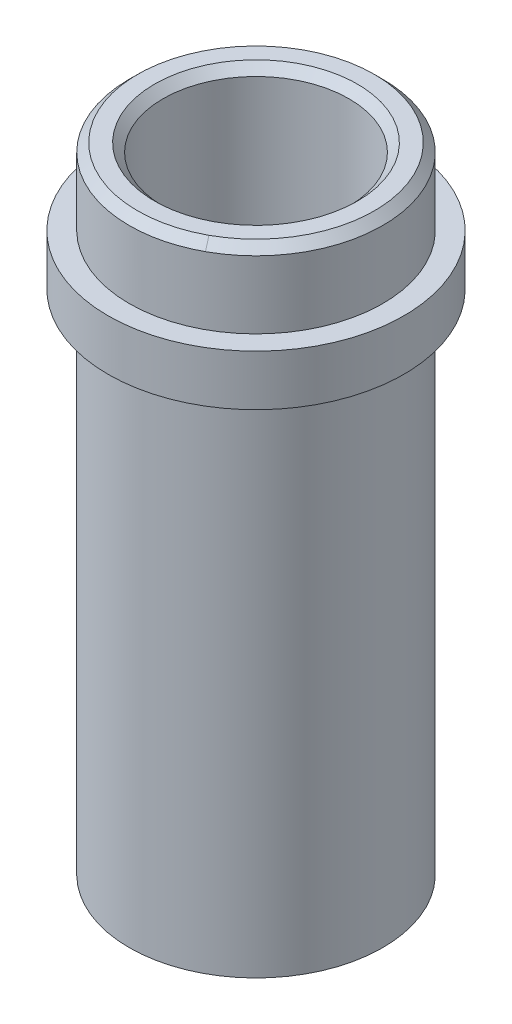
ISO-10303-21;
HEADER;
FILE_DESCRIPTION(('STEP AP214'),'2;1');
FILE_NAME('part.step','',(''),(''),'','','');
FILE_SCHEMA(('AUTOMOTIVE_DESIGN { 1 0 10303 214 1 1 1 1 }'));
ENDSEC;
DATA;
#1=APPLICATION_CONTEXT('core data for automotive mechanical design processes');
#2=APPLICATION_PROTOCOL_DEFINITION('international standard','automotive_design',2000,#1);
#3=PRODUCT_CONTEXT('',#1,'mechanical');
#4=PRODUCT('Part','Part','',(#3));
#5=PRODUCT_RELATED_PRODUCT_CATEGORY('part','',(#4));
#6=PRODUCT_DEFINITION_FORMATION('','',#4);
#7=PRODUCT_DEFINITION_CONTEXT('part definition',#1,'design');
#8=PRODUCT_DEFINITION('design','',#6,#7);
#9=PRODUCT_DEFINITION_SHAPE('','',#8);
#10=(LENGTH_UNIT() NAMED_UNIT(*) SI_UNIT(.MILLI.,.METRE.));
#11=(NAMED_UNIT(*) PLANE_ANGLE_UNIT() SI_UNIT($,.RADIAN.));
#12=(NAMED_UNIT(*) SI_UNIT($,.STERADIAN.) SOLID_ANGLE_UNIT());
#13=UNCERTAINTY_MEASURE_WITH_UNIT(LENGTH_MEASURE(1.E-05),#10,'distance_accuracy_value','');
#14=(GEOMETRIC_REPRESENTATION_CONTEXT(3) GLOBAL_UNCERTAINTY_ASSIGNED_CONTEXT((#13)) GLOBAL_UNIT_ASSIGNED_CONTEXT((#10,
#11,#12)) REPRESENTATION_CONTEXT('',''));
#15=CARTESIAN_POINT('',(0.,0.,0.));
#16=DIRECTION('',(0.,0.,1.));
#17=DIRECTION('',(1.,0.,0.));
#18=AXIS2_PLACEMENT_3D('',#15,#16,#17);
#19=CARTESIAN_POINT('',(0.,-4.04476165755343,0.));
#20=DIRECTION('',(0.,-1.,0.));
#21=DIRECTION('',(1.,0.,0.));
#22=AXIS2_PLACEMENT_3D('',#19,#20,#21);
#23=CONICAL_SURFACE('',#22,14.9999999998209,0.785398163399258);
#24=DIRECTION('',(-0.339005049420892,0.707106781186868,-0.620544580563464));
#25=VECTOR('',#24,1.);
#26=CARTESIAN_POINT('',(239238.595984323,-499000.,437923.312509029));
#27=LINE('',#26,#25);
#28=CARTESIAN_POINT('',(6.71195754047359,-3.04476165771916,12.2861558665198));
#29=VERTEX_POINT('',#28);
#30=CARTESIAN_POINT('',(7.19138307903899,-4.04476165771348,13.1637384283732));
#31=VERTEX_POINT('',#30);
#32=EDGE_CURVE('E33',#29,#31,#27,.F.);
#33=ORIENTED_EDGE('',*,*,#32,.F.);
#34=CARTESIAN_POINT('',(0.,-3.04476165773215,0.));
#35=DIRECTION('',(0.,-1.,0.));
#36=DIRECTION('',(1.,0.,0.));
#37=AXIS2_PLACEMENT_3D('',#34,#35,#36);
#38=CIRCLE('',#37,13.999999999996);
#39=CARTESIAN_POINT('',(-6.71195758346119,-3.04476165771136,-12.2861558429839));
#40=VERTEX_POINT('',#39);
#41=EDGE_CURVE('E20',#40,#29,#38,.F.);
#42=ORIENTED_EDGE('',*,*,#41,.F.);
#43=CARTESIAN_POINT('',(-7.1913830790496,-4.04476165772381,-13.163738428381));
#44=CARTESIAN_POINT('',(-7.17140701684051,-4.003094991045,-13.1271724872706));
#45=CARTESIAN_POINT('',(-7.15143095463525,-3.96142832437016,-13.0906065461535));
#46=CARTESIAN_POINT('',(-7.11147883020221,-3.87809499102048,-13.017474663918));
#47=CARTESIAN_POINT('',(-7.09150276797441,-3.83642832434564,-12.9809087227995));
#48=CARTESIAN_POINT('',(-7.05155064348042,-3.7530949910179,-12.9077768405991));
#49=CARTESIAN_POINT('',(-7.03157458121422,-3.711428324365,-12.8712108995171));
#50=CARTESIAN_POINT('',(-6.99162245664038,-3.62809499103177,-12.7980790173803));
#51=CARTESIAN_POINT('',(-6.97164639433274,-3.58642832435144,-12.7615130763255));
#52=CARTESIAN_POINT('',(-6.93169426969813,-3.50309499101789,-12.6883811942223));
#53=CARTESIAN_POINT('',(-6.91171820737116,-3.46142832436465,-12.6518152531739));
#54=CARTESIAN_POINT('',(-6.8717660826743,-3.37809499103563,-12.5786833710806));
#55=CARTESIAN_POINT('',(-6.85179002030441,-3.33642832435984,-12.5421174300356));
#56=CARTESIAN_POINT('',(-6.81183789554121,-3.25309499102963,-12.4689855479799));
#57=CARTESIAN_POINT('',(-6.79186183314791,-3.21142832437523,-12.4324196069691));
#58=CARTESIAN_POINT('',(-6.7519097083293,-3.12809499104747,-12.3592877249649));
#59=CARTESIAN_POINT('',(-6.73193364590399,-3.08642832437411,-12.3227217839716));
#60=CARTESIAN_POINT('',(-6.71195758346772,-3.04476165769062,-12.2861558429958));
#61=B_SPLINE_CURVE_WITH_KNOTS('',3,(#43,#44,#45,#46,#47,#48,#49,#50,#51,#52,#53,#54,#55,#56,#57,
#58,#59,#60),.UNSPECIFIED.,.F.,.F.,(4,2,2,2,2,2,2,2,4),(0.,0.176776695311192,0.353553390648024,
0.530330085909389,0.707106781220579,0.883883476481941,1.06066017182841,1.23743686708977,
1.41421356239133),.UNSPECIFIED.);
#62=CARTESIAN_POINT('',(-7.19138307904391,-4.04476165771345,-13.1637384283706));
#63=VERTEX_POINT('',#62);
#64=EDGE_CURVE('E42',#63,#40,#61,.T.);
#65=ORIENTED_EDGE('',*,*,#64,.F.);
#66=CARTESIAN_POINT('',(0.,-4.04476165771,0.));
#67=DIRECTION('',(0.,1.,0.));
#68=DIRECTION('',(0.,0.,1.));
#69=AXIS2_PLACEMENT_3D('',#66,#67,#68);
#70=CIRCLE('',#69,15.);
#71=EDGE_CURVE('E45',#31,#63,#70,.F.);
#72=ORIENTED_EDGE('',*,*,#71,.F.);
#73=EDGE_LOOP('',(#33,#42,#65,#72));
#74=FACE_BOUND('',#73,.T.);
#75=ADVANCED_FACE('F16',(#74),#23,.T.);
#76=CARTESIAN_POINT('',(0.,-4.04476165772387,0.));
#77=DIRECTION('',(0.,-1.,0.));
#78=DIRECTION('',(0.,0.,-1.));
#79=AXIS2_PLACEMENT_3D('',#76,#77,#78);
#80=CONICAL_SURFACE('',#79,15.0000000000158,0.785398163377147);
#81=ORIENTED_EDGE('',*,*,#64,.T.);
#82=CARTESIAN_POINT('',(0.,-3.04476165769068,0.));
#83=DIRECTION('',(0.,-1.,0.));
#84=DIRECTION('',(0.,0.,-1.));
#85=AXIS2_PLACEMENT_3D('',#82,#83,#84);
#86=CIRCLE('',#85,14.0000000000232);
#87=EDGE_CURVE('E56',#29,#40,#86,.F.);
#88=ORIENTED_EDGE('',*,*,#87,.F.);
#89=ORIENTED_EDGE('',*,*,#32,.T.);
#90=CARTESIAN_POINT('',(0.,-4.04476165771,0.));
#91=DIRECTION('',(0.,1.,0.));
#92=DIRECTION('',(0.,0.,1.));
#93=AXIS2_PLACEMENT_3D('',#90,#91,#92);
#94=CIRCLE('',#93,15.);
#95=EDGE_CURVE('E48',#63,#31,#94,.F.);
#96=ORIENTED_EDGE('',*,*,#95,.F.);
#97=EDGE_LOOP('',(#81,#88,#89,#96));
#98=FACE_BOUND('',#97,.T.);
#99=ADVANCED_FACE('F51',(#98),#80,.T.);
#100=CARTESIAN_POINT('',(0.,-40.5447616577,0.));
#101=DIRECTION('',(0.,1.,0.));
#102=DIRECTION('',(0.,0.,1.));
#103=AXIS2_PLACEMENT_3D('',#100,#101,#102);
#104=CYLINDRICAL_SURFACE('',#103,15.);
#105=CARTESIAN_POINT('',(0.,-12.0447616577,0.));
#106=DIRECTION('',(0.,1.,0.));
#107=DIRECTION('',(0.,0.,1.));
#108=AXIS2_PLACEMENT_3D('',#105,#106,#107);
#109=CIRCLE('',#108,15.);
#110=CARTESIAN_POINT('',(0.,-12.0447616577,15.));
#111=VERTEX_POINT('',#110);
#112=EDGE_CURVE('E77',#111,#111,#109,.F.);
#113=ORIENTED_EDGE('',*,*,#112,.F.);
#114=EDGE_LOOP('',(#113));
#115=FACE_BOUND('',#114,.T.);
#116=ORIENTED_EDGE('',*,*,#71,.T.);
#117=ORIENTED_EDGE('',*,*,#95,.T.);
#118=EDGE_LOOP('',(#116,#117));
#119=FACE_BOUND('',#118,.T.);
#120=ADVANCED_FACE('F54',(#115,#119),#104,.T.);
#121=CARTESIAN_POINT('',(0.,-3.04476165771,15.));
#122=DIRECTION('',(0.,1.,0.));
#123=DIRECTION('',(0.,0.,1.));
#124=AXIS2_PLACEMENT_3D('',#121,#122,#123);
#125=PLANE('',#124);
#126=CARTESIAN_POINT('',(0.,-3.0447616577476,0.));
#127=DIRECTION('',(0.,1.,0.));
#128=DIRECTION('',(-1.,0.,0.));
#129=AXIS2_PLACEMENT_3D('',#126,#127,#128);
#130=CIRCLE('',#129,11.9999999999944);
#131=CARTESIAN_POINT('',(-11.9999999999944,-3.04476165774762,0.));
#132=VERTEX_POINT('',#131);
#133=EDGE_CURVE('E74',#132,#132,#130,.F.);
#134=ORIENTED_EDGE('',*,*,#133,.T.);
#135=EDGE_LOOP('',(#134));
#136=FACE_BOUND('',#135,.T.);
#137=ORIENTED_EDGE('',*,*,#41,.T.);
#138=ORIENTED_EDGE('',*,*,#87,.T.);
#139=EDGE_LOOP('',(#137,#138));
#140=FACE_BOUND('',#139,.T.);
#141=ADVANCED_FACE('F80',(#136,#140),#125,.T.);
#142=CARTESIAN_POINT('',(0.,-12.0447616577,15.));
#143=DIRECTION('',(0.,1.,0.));
#144=DIRECTION('',(0.,0.,1.));
#145=AXIS2_PLACEMENT_3D('',#142,#143,#144);
#146=PLANE('',#145);
#147=ORIENTED_EDGE('',*,*,#112,.T.);
#148=EDGE_LOOP('',(#147));
#149=FACE_BOUND('',#148,.T.);
#150=CARTESIAN_POINT('',(0.,-12.0447616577,0.));
#151=DIRECTION('',(0.,1.,0.));
#152=DIRECTION('',(0.,0.,1.));
#153=AXIS2_PLACEMENT_3D('',#150,#151,#152);
#154=CIRCLE('',#153,17.5);
#155=CARTESIAN_POINT('',(0.,-12.0447616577,17.5));
#156=VERTEX_POINT('',#155);
#157=EDGE_CURVE('E71',#156,#156,#154,.F.);
#158=ORIENTED_EDGE('',*,*,#157,.F.);
#159=EDGE_LOOP('',(#158));
#160=FACE_BOUND('',#159,.T.);
#161=ADVANCED_FACE('F82',(#149,#160),#146,.T.);
#162=CARTESIAN_POINT('',(0.,-3.0447616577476,0.));
#163=DIRECTION('',(0.,1.,0.));
#164=DIRECTION('',(-1.,0.,0.));
#165=AXIS2_PLACEMENT_3D('',#162,#163,#164);
#166=CONICAL_SURFACE('',#165,11.9999999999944,0.785398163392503);
#167=ORIENTED_EDGE('',*,*,#133,.F.);
#168=EDGE_LOOP('',(#167));
#169=FACE_BOUND('',#168,.T.);
#170=CARTESIAN_POINT('',(0.,-4.04476165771,0.));
#171=DIRECTION('',(0.,1.,0.));
#172=DIRECTION('',(0.,0.,1.));
#173=AXIS2_PLACEMENT_3D('',#170,#171,#172);
#174=CIRCLE('',#173,11.);
#175=CARTESIAN_POINT('',(0.,-4.04476165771,11.));
#176=VERTEX_POINT('',#175);
#177=EDGE_CURVE('E70',#176,#176,#174,.F.);
#178=ORIENTED_EDGE('',*,*,#177,.T.);
#179=EDGE_LOOP('',(#178));
#180=FACE_BOUND('',#179,.T.);
#181=ADVANCED_FACE('F90',(#169,#180),#166,.F.);
#182=CARTESIAN_POINT('',(0.,-40.5447616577,0.));
#183=DIRECTION('',(0.,1.,0.));
#184=DIRECTION('',(0.,0.,1.));
#185=AXIS2_PLACEMENT_3D('',#182,#183,#184);
#186=CYLINDRICAL_SURFACE('',#185,17.5);
#187=CARTESIAN_POINT('',(0.,-18.0447616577,0.));
#188=DIRECTION('',(0.,1.,0.));
#189=DIRECTION('',(0.,0.,1.));
#190=AXIS2_PLACEMENT_3D('',#187,#188,#189);
#191=CIRCLE('',#190,17.5);
#192=CARTESIAN_POINT('',(0.,-18.0447616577,17.5));
#193=VERTEX_POINT('',#192);
#194=EDGE_CURVE('E67',#193,#193,#191,.T.);
#195=ORIENTED_EDGE('',*,*,#194,.T.);
#196=EDGE_LOOP('',(#195));
#197=FACE_BOUND('',#196,.T.);
#198=ORIENTED_EDGE('',*,*,#157,.T.);
#199=EDGE_LOOP('',(#198));
#200=FACE_BOUND('',#199,.T.);
#201=ADVANCED_FACE('F113',(#197,#200),#186,.T.);
#202=CARTESIAN_POINT('',(0.,-40.5447616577,0.));
#203=DIRECTION('',(0.,1.,0.));
#204=DIRECTION('',(0.,0.,1.));
#205=AXIS2_PLACEMENT_3D('',#202,#203,#204);
#206=CYLINDRICAL_SURFACE('',#205,11.);
#207=CARTESIAN_POINT('',(0.,-78.0447616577,0.));
#208=DIRECTION('',(0.,1.,0.));
#209=DIRECTION('',(0.,0.,1.));
#210=AXIS2_PLACEMENT_3D('',#207,#208,#209);
#211=CIRCLE('',#210,11.);
#212=CARTESIAN_POINT('',(0.,-78.0447616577,11.));
#213=VERTEX_POINT('',#212);
#214=EDGE_CURVE('E64',#213,#213,#211,.F.);
#215=ORIENTED_EDGE('',*,*,#214,.T.);
#216=EDGE_LOOP('',(#215));
#217=FACE_BOUND('',#216,.T.);
#218=ORIENTED_EDGE('',*,*,#177,.F.);
#219=EDGE_LOOP('',(#218));
#220=FACE_BOUND('',#219,.T.);
#221=ADVANCED_FACE('F109',(#217,#220),#206,.F.);
#222=CARTESIAN_POINT('',(0.,-18.0447616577,17.5));
#223=DIRECTION('',(0.,1.,0.));
#224=DIRECTION('',(0.,0.,1.));
#225=AXIS2_PLACEMENT_3D('',#222,#223,#224);
#226=PLANE('',#225);
#227=CARTESIAN_POINT('',(0.,-18.0447616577,0.));
#228=DIRECTION('',(0.,1.,0.));
#229=DIRECTION('',(0.,0.,1.));
#230=AXIS2_PLACEMENT_3D('',#227,#228,#229);
#231=CIRCLE('',#230,15.);
#232=CARTESIAN_POINT('',(0.,-18.0447616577,15.));
#233=VERTEX_POINT('',#232);
#234=EDGE_CURVE('E25',#233,#233,#231,.F.);
#235=ORIENTED_EDGE('',*,*,#234,.F.);
#236=EDGE_LOOP('',(#235));
#237=FACE_BOUND('',#236,.T.);
#238=ORIENTED_EDGE('',*,*,#194,.F.);
#239=EDGE_LOOP('',(#238));
#240=FACE_BOUND('',#239,.T.);
#241=ADVANCED_FACE('F101',(#237,#240),#226,.F.);
#242=CARTESIAN_POINT('',(0.,-78.0447616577,15.));
#243=DIRECTION('',(0.,1.,0.));
#244=DIRECTION('',(0.,0.,1.));
#245=AXIS2_PLACEMENT_3D('',#242,#243,#244);
#246=PLANE('',#245);
#247=ORIENTED_EDGE('',*,*,#214,.F.);
#248=EDGE_LOOP('',(#247));
#249=FACE_BOUND('',#248,.T.);
#250=CARTESIAN_POINT('',(0.,-78.0447616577,0.));
#251=DIRECTION('',(0.,1.,0.));
#252=DIRECTION('',(0.,0.,1.));
#253=AXIS2_PLACEMENT_3D('',#250,#251,#252);
#254=CIRCLE('',#253,15.);
#255=CARTESIAN_POINT('',(0.,-78.0447616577,15.));
#256=VERTEX_POINT('',#255);
#257=EDGE_CURVE('E11',#256,#256,#254,.T.);
#258=ORIENTED_EDGE('',*,*,#257,.F.);
#259=EDGE_LOOP('',(#258));
#260=FACE_BOUND('',#259,.T.);
#261=ADVANCED_FACE('F96',(#249,#260),#246,.F.);
#262=CARTESIAN_POINT('',(0.,-40.5447616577,0.));
#263=DIRECTION('',(0.,1.,0.));
#264=DIRECTION('',(0.,0.,1.));
#265=AXIS2_PLACEMENT_3D('',#262,#263,#264);
#266=CYLINDRICAL_SURFACE('',#265,15.);
#267=ORIENTED_EDGE('',*,*,#257,.T.);
#268=EDGE_LOOP('',(#267));
#269=FACE_BOUND('',#268,.T.);
#270=ORIENTED_EDGE('',*,*,#234,.T.);
#271=EDGE_LOOP('',(#270));
#272=FACE_BOUND('',#271,.T.);
#273=ADVANCED_FACE('F18',(#269,#272),#266,.T.);
#274=CLOSED_SHELL('',(#75,#99,#120,#141,#161,#181,#201,#221,#241,#261,#273));
#275=MANIFOLD_SOLID_BREP('B1',#274);
#276=ADVANCED_BREP_SHAPE_REPRESENTATION('',(#18,#275),#14);
#277=SHAPE_DEFINITION_REPRESENTATION(#9,#276);
ENDSEC;
END-ISO-10303-21;
